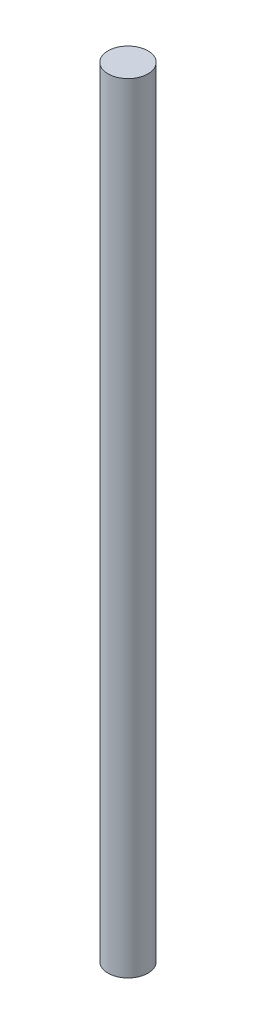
ISO-10303-21;
HEADER;
FILE_DESCRIPTION(('STEP AP214'),'2;1');
FILE_NAME('part.step','',(''),(''),'','','');
FILE_SCHEMA(('AUTOMOTIVE_DESIGN { 1 0 10303 214 1 1 1 1 }'));
ENDSEC;
DATA;
#1=APPLICATION_CONTEXT('core data for automotive mechanical design processes');
#2=APPLICATION_PROTOCOL_DEFINITION('international standard','automotive_design',2000,#1);
#3=PRODUCT_CONTEXT('',#1,'mechanical');
#4=PRODUCT('Part','Part','',(#3));
#5=PRODUCT_RELATED_PRODUCT_CATEGORY('part','',(#4));
#6=PRODUCT_DEFINITION_FORMATION('','',#4);
#7=PRODUCT_DEFINITION_CONTEXT('part definition',#1,'design');
#8=PRODUCT_DEFINITION('design','',#6,#7);
#9=PRODUCT_DEFINITION_SHAPE('','',#8);
#10=(LENGTH_UNIT() NAMED_UNIT(*) SI_UNIT(.MILLI.,.METRE.));
#11=(NAMED_UNIT(*) PLANE_ANGLE_UNIT() SI_UNIT($,.RADIAN.));
#12=(NAMED_UNIT(*) SI_UNIT($,.STERADIAN.) SOLID_ANGLE_UNIT());
#13=UNCERTAINTY_MEASURE_WITH_UNIT(LENGTH_MEASURE(1.E-05),#10,'distance_accuracy_value','');
#14=(GEOMETRIC_REPRESENTATION_CONTEXT(3) GLOBAL_UNCERTAINTY_ASSIGNED_CONTEXT((#13)) GLOBAL_UNIT_ASSIGNED_CONTEXT((#10,
#11,#12)) REPRESENTATION_CONTEXT('',''));
#15=CARTESIAN_POINT('',(0.,0.,0.));
#16=DIRECTION('',(0.,0.,1.));
#17=DIRECTION('',(1.,0.,0.));
#18=AXIS2_PLACEMENT_3D('',#15,#16,#17);
#19=CARTESIAN_POINT('',(0.,156.,0.));
#20=DIRECTION('',(0.,-1.,0.));
#21=DIRECTION('',(0.,0.,-1.));
#22=AXIS2_PLACEMENT_3D('',#19,#20,#21);
#23=CYLINDRICAL_SURFACE('',#22,4.);
#24=CARTESIAN_POINT('',(0.,156.,0.));
#25=DIRECTION('',(0.,1.,0.));
#26=DIRECTION('',(0.,0.,1.));
#27=AXIS2_PLACEMENT_3D('',#24,#25,#26);
#28=CIRCLE('',#27,4.);
#29=CARTESIAN_POINT('',(0.,156.,4.));
#30=VERTEX_POINT('',#29);
#31=EDGE_CURVE('E10',#30,#30,#28,.T.);
#32=ORIENTED_EDGE('',*,*,#31,.F.);
#33=EDGE_LOOP('',(#32));
#34=FACE_BOUND('',#33,.T.);
#35=CARTESIAN_POINT('',(0.,0.,0.));
#36=DIRECTION('',(0.,1.,0.));
#37=DIRECTION('',(0.,0.,1.));
#38=AXIS2_PLACEMENT_3D('',#35,#36,#37);
#39=CIRCLE('',#38,4.);
#40=CARTESIAN_POINT('',(0.,0.,4.));
#41=VERTEX_POINT('',#40);
#42=EDGE_CURVE('E34',#41,#41,#39,.T.);
#43=ORIENTED_EDGE('',*,*,#42,.T.);
#44=EDGE_LOOP('',(#43));
#45=FACE_BOUND('',#44,.T.);
#46=ADVANCED_FACE('F31',(#34,#45),#23,.T.);
#47=CARTESIAN_POINT('',(0.,156.,0.));
#48=DIRECTION('',(0.,1.,0.));
#49=DIRECTION('',(0.,0.,1.));
#50=AXIS2_PLACEMENT_3D('',#47,#48,#49);
#51=PLANE('',#50);
#52=ORIENTED_EDGE('',*,*,#31,.T.);
#53=EDGE_LOOP('',(#52));
#54=FACE_BOUND('',#53,.T.);
#55=ADVANCED_FACE('F46',(#54),#51,.T.);
#56=CARTESIAN_POINT('',(0.,0.,0.));
#57=DIRECTION('',(0.,1.,0.));
#58=DIRECTION('',(0.,0.,1.));
#59=AXIS2_PLACEMENT_3D('',#56,#57,#58);
#60=PLANE('',#59);
#61=ORIENTED_EDGE('',*,*,#42,.F.);
#62=EDGE_LOOP('',(#61));
#63=FACE_BOUND('',#62,.T.);
#64=ADVANCED_FACE('F44',(#63),#60,.F.);
#65=CLOSED_SHELL('',(#46,#55,#64));
#66=MANIFOLD_SOLID_BREP('B2',#65);
#67=ADVANCED_BREP_SHAPE_REPRESENTATION('',(#18,#66),#14);
#68=SHAPE_DEFINITION_REPRESENTATION(#9,#67);
ENDSEC;
END-ISO-10303-21;
